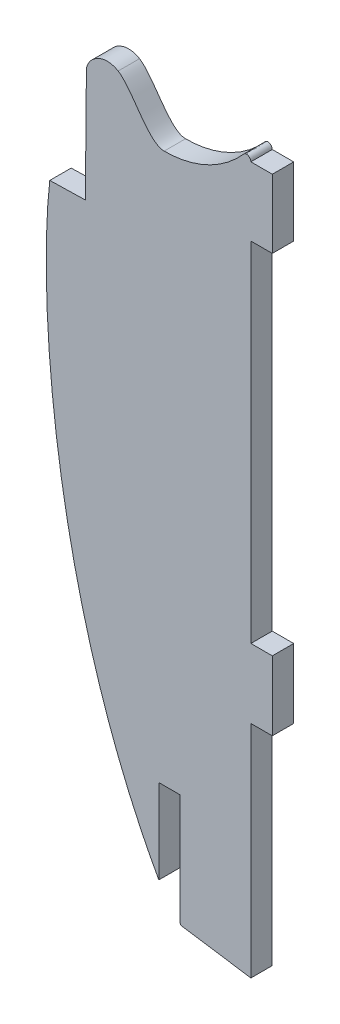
ISO-10303-21;
HEADER;
FILE_DESCRIPTION(('STEP AP214'),'2;1');
FILE_NAME('part.step','',(''),(''),'','','');
FILE_SCHEMA(('AUTOMOTIVE_DESIGN { 1 0 10303 214 1 1 1 1 }'));
ENDSEC;
DATA;
#1=APPLICATION_CONTEXT('core data for automotive mechanical design processes');
#2=APPLICATION_PROTOCOL_DEFINITION('international standard','automotive_design',2000,#1);
#3=PRODUCT_CONTEXT('',#1,'mechanical');
#4=PRODUCT('Part','Part','',(#3));
#5=PRODUCT_RELATED_PRODUCT_CATEGORY('part','',(#4));
#6=PRODUCT_DEFINITION_FORMATION('','',#4);
#7=PRODUCT_DEFINITION_CONTEXT('part definition',#1,'design');
#8=PRODUCT_DEFINITION('design','',#6,#7);
#9=PRODUCT_DEFINITION_SHAPE('','',#8);
#10=(LENGTH_UNIT() NAMED_UNIT(*) SI_UNIT(.MILLI.,.METRE.));
#11=(NAMED_UNIT(*) PLANE_ANGLE_UNIT() SI_UNIT($,.RADIAN.));
#12=(NAMED_UNIT(*) SI_UNIT($,.STERADIAN.) SOLID_ANGLE_UNIT());
#13=UNCERTAINTY_MEASURE_WITH_UNIT(LENGTH_MEASURE(1.E-05),#10,'distance_accuracy_value','');
#14=(GEOMETRIC_REPRESENTATION_CONTEXT(3) GLOBAL_UNCERTAINTY_ASSIGNED_CONTEXT((#13)) GLOBAL_UNIT_ASSIGNED_CONTEXT((#10,
#11,#12)) REPRESENTATION_CONTEXT('',''));
#15=CARTESIAN_POINT('',(0.,0.,0.));
#16=DIRECTION('',(0.,0.,1.));
#17=DIRECTION('',(1.,0.,0.));
#18=AXIS2_PLACEMENT_3D('',#15,#16,#17);
#19=CARTESIAN_POINT('',(661.833021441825,564.04560696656,3.));
#20=CARTESIAN_POINT('',(663.48081061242,559.870926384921,3.));
#21=CARTESIAN_POINT('',(665.367689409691,555.794258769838,3.));
#22=CARTESIAN_POINT('',(667.524146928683,551.909569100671,3.));
#23=B_SPLINE_CURVE_WITH_KNOTS('',3,(#19,#20,#21,#22),.UNSPECIFIED.,.F.,.F.,(4,4),(0.,1.),.UNSPECIFIED.);
#24=DIRECTION('',(0.,0.,-1.));
#25=VECTOR('',#24,1.);
#26=SURFACE_OF_LINEAR_EXTRUSION('',#23,#25);
#27=CARTESIAN_POINT('',(661.833021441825,564.04560696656,0.));
#28=CARTESIAN_POINT('',(663.48081061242,559.870926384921,0.));
#29=CARTESIAN_POINT('',(665.367689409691,555.794258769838,0.));
#30=CARTESIAN_POINT('',(667.524146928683,551.909569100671,0.));
#31=B_SPLINE_CURVE_WITH_KNOTS('',3,(#27,#28,#29,#30),.UNSPECIFIED.,.F.,.F.,(4,4),(0.,1.),.UNSPECIFIED.);
#32=CARTESIAN_POINT('',(661.833021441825,564.04560696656,0.));
#33=VERTEX_POINT('',#32);
#34=CARTESIAN_POINT('',(667.524146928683,551.909569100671,0.));
#35=VERTEX_POINT('',#34);
#36=EDGE_CURVE('E11',#33,#35,#31,.T.);
#37=ORIENTED_EDGE('',*,*,#36,.T.);
#38=DIRECTION('',(0.,0.,-1.));
#39=VECTOR('',#38,1.);
#40=CARTESIAN_POINT('',(667.524146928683,551.909569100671,3.));
#41=LINE('',#40,#39);
#42=CARTESIAN_POINT('',(667.524146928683,551.909569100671,3.));
#43=VERTEX_POINT('',#42);
#44=EDGE_CURVE('E940',#43,#35,#41,.T.);
#45=ORIENTED_EDGE('',*,*,#44,.F.);
#46=CARTESIAN_POINT('',(661.833021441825,564.04560696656,3.));
#47=VERTEX_POINT('',#46);
#48=EDGE_CURVE('E47',#47,#43,#23,.T.);
#49=ORIENTED_EDGE('',*,*,#48,.F.);
#50=DIRECTION('',(0.,0.,-1.));
#51=VECTOR('',#50,1.);
#52=CARTESIAN_POINT('',(661.833021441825,564.04560696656,3.));
#53=LINE('',#52,#51);
#54=EDGE_CURVE('E279',#47,#33,#53,.T.);
#55=ORIENTED_EDGE('',*,*,#54,.T.);
#56=EDGE_LOOP('',(#37,#45,#49,#55));
#57=FACE_BOUND('',#56,.T.);
#58=ADVANCED_FACE('F44',(#57),#26,.F.);
#59=CARTESIAN_POINT('',(667.524146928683,551.909569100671,3.));
#60=DIRECTION('',(-1.,0.,0.));
#61=DIRECTION('',(0.,0.,1.));
#62=AXIS2_PLACEMENT_3D('',#59,#60,#61);
#63=PLANE('',#62);
#64=DIRECTION('',(0.,1.,0.));
#65=VECTOR('',#64,1.);
#66=CARTESIAN_POINT('',(667.524146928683,551.909569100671,0.));
#67=LINE('',#66,#65);
#68=CARTESIAN_POINT('',(667.524146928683,563.738304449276,0.));
#69=VERTEX_POINT('',#68);
#70=EDGE_CURVE('E56',#35,#69,#67,.T.);
#71=ORIENTED_EDGE('',*,*,#70,.T.);
#72=DIRECTION('',(0.,0.,-1.));
#73=VECTOR('',#72,1.);
#74=CARTESIAN_POINT('',(667.524146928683,563.738304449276,3.));
#75=LINE('',#74,#73);
#76=CARTESIAN_POINT('',(667.524146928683,563.738304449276,3.));
#77=VERTEX_POINT('',#76);
#78=EDGE_CURVE('E245',#77,#69,#75,.T.);
#79=ORIENTED_EDGE('',*,*,#78,.F.);
#80=DIRECTION('',(0.,1.,0.));
#81=VECTOR('',#80,1.);
#82=CARTESIAN_POINT('',(667.524146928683,551.909569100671,3.));
#83=LINE('',#82,#81);
#84=EDGE_CURVE('E155',#43,#77,#83,.T.);
#85=ORIENTED_EDGE('',*,*,#84,.F.);
#86=ORIENTED_EDGE('',*,*,#44,.T.);
#87=EDGE_LOOP('',(#71,#79,#85,#86));
#88=FACE_BOUND('',#87,.T.);
#89=ADVANCED_FACE('F307',(#88),#63,.F.);
#90=CARTESIAN_POINT('',(667.524146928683,563.738304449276,3.));
#91=DIRECTION('',(0.,1.,0.));
#92=DIRECTION('',(0.,0.,1.));
#93=AXIS2_PLACEMENT_3D('',#90,#91,#92);
#94=PLANE('',#93);
#95=DIRECTION('',(1.,0.,0.));
#96=VECTOR('',#95,1.);
#97=CARTESIAN_POINT('',(667.524146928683,563.738304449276,0.));
#98=LINE('',#97,#96);
#99=CARTESIAN_POINT('',(670.52620313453,563.738304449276,0.));
#100=VERTEX_POINT('',#99);
#101=EDGE_CURVE('E240',#69,#100,#98,.T.);
#102=ORIENTED_EDGE('',*,*,#101,.T.);
#103=DIRECTION('',(0.,0.,-1.));
#104=VECTOR('',#103,1.);
#105=CARTESIAN_POINT('',(670.52620313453,563.738304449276,3.));
#106=LINE('',#105,#104);
#107=CARTESIAN_POINT('',(670.52620313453,563.738304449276,3.));
#108=VERTEX_POINT('',#107);
#109=EDGE_CURVE('E242',#108,#100,#106,.T.);
#110=ORIENTED_EDGE('',*,*,#109,.F.);
#111=DIRECTION('',(1.,0.,0.));
#112=VECTOR('',#111,1.);
#113=CARTESIAN_POINT('',(667.524146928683,563.738304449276,3.));
#114=LINE('',#113,#112);
#115=EDGE_CURVE('E351',#77,#108,#114,.T.);
#116=ORIENTED_EDGE('',*,*,#115,.F.);
#117=ORIENTED_EDGE('',*,*,#78,.T.);
#118=EDGE_LOOP('',(#102,#110,#116,#117));
#119=FACE_BOUND('',#118,.T.);
#120=ADVANCED_FACE('F239',(#119),#94,.F.);
#121=CARTESIAN_POINT('',(670.52620313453,563.738304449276,3.));
#122=DIRECTION('',(1.,0.,0.));
#123=DIRECTION('',(0.,0.,-1.));
#124=AXIS2_PLACEMENT_3D('',#121,#122,#123);
#125=PLANE('',#124);
#126=DIRECTION('',(0.,-1.,0.));
#127=VECTOR('',#126,1.);
#128=CARTESIAN_POINT('',(670.52620313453,563.738304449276,0.));
#129=LINE('',#128,#127);
#130=CARTESIAN_POINT('',(670.52620313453,548.092575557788,0.));
#131=VERTEX_POINT('',#130);
#132=EDGE_CURVE('E247',#100,#131,#129,.T.);
#133=ORIENTED_EDGE('',*,*,#132,.T.);
#134=DIRECTION('',(0.,0.,-1.));
#135=VECTOR('',#134,1.);
#136=CARTESIAN_POINT('',(670.52620313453,548.092575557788,3.));
#137=LINE('',#136,#135);
#138=CARTESIAN_POINT('',(670.52620313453,548.092575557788,3.));
#139=VERTEX_POINT('',#138);
#140=EDGE_CURVE('E255',#139,#131,#137,.T.);
#141=ORIENTED_EDGE('',*,*,#140,.F.);
#142=DIRECTION('',(0.,-1.,0.));
#143=VECTOR('',#142,1.);
#144=CARTESIAN_POINT('',(670.52620313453,563.738304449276,3.));
#145=LINE('',#144,#143);
#146=EDGE_CURVE('E252',#108,#139,#145,.T.);
#147=ORIENTED_EDGE('',*,*,#146,.F.);
#148=ORIENTED_EDGE('',*,*,#109,.T.);
#149=EDGE_LOOP('',(#133,#141,#147,#148));
#150=FACE_BOUND('',#149,.T.);
#151=ADVANCED_FACE('F246',(#150),#125,.F.);
#152=CARTESIAN_POINT('',(670.52620313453,548.092575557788,3.));
#153=DIRECTION('',(0.79190468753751,0.610644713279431,0.));
#154=DIRECTION('',(-0.610644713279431,0.79190468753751,0.));
#155=AXIS2_PLACEMENT_3D('',#152,#153,#154);
#156=PLANE('',#155);
#157=DIRECTION('',(0.610644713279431,-0.79190468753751,0.));
#158=VECTOR('',#157,1.);
#159=CARTESIAN_POINT('',(670.52620313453,548.092575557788,0.));
#160=LINE('',#159,#158);
#161=CARTESIAN_POINT('',(670.656772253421,547.923249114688,0.));
#162=VERTEX_POINT('',#161);
#163=EDGE_CURVE('E259',#131,#162,#160,.T.);
#164=ORIENTED_EDGE('',*,*,#163,.T.);
#165=DIRECTION('',(0.,0.,-1.));
#166=VECTOR('',#165,1.);
#167=CARTESIAN_POINT('',(670.656772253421,547.923249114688,3.));
#168=LINE('',#167,#166);
#169=CARTESIAN_POINT('',(670.656772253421,547.923249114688,3.));
#170=VERTEX_POINT('',#169);
#171=EDGE_CURVE('E466',#170,#162,#168,.T.);
#172=ORIENTED_EDGE('',*,*,#171,.F.);
#173=DIRECTION('',(0.610644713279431,-0.79190468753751,0.));
#174=VECTOR('',#173,1.);
#175=CARTESIAN_POINT('',(670.52620313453,548.092575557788,3.));
#176=LINE('',#175,#174);
#177=EDGE_CURVE('E349',#139,#170,#176,.T.);
#178=ORIENTED_EDGE('',*,*,#177,.F.);
#179=ORIENTED_EDGE('',*,*,#140,.T.);
#180=EDGE_LOOP('',(#164,#172,#178,#179));
#181=FACE_BOUND('',#180,.T.);
#182=ADVANCED_FACE('F317',(#181),#156,.F.);
#183=CARTESIAN_POINT('',(670.656772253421,547.923249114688,3.));
#184=DIRECTION('',(0.148954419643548,0.988844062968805,0.));
#185=DIRECTION('',(-0.988844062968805,0.148954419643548,0.));
#186=AXIS2_PLACEMENT_3D('',#183,#184,#185);
#187=PLANE('',#186);
#188=DIRECTION('',(0.988844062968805,-0.148954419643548,0.));
#189=VECTOR('',#188,1.);
#190=CARTESIAN_POINT('',(670.656772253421,547.923249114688,0.));
#191=LINE('',#190,#189);
#192=CARTESIAN_POINT('',(677.588821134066,546.879040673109,0.));
#193=VERTEX_POINT('',#192);
#194=EDGE_CURVE('E263',#162,#193,#191,.T.);
#195=ORIENTED_EDGE('',*,*,#194,.T.);
#196=DIRECTION('',(0.,0.,-1.));
#197=VECTOR('',#196,1.);
#198=CARTESIAN_POINT('',(677.588821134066,546.879040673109,3.));
#199=LINE('',#198,#197);
#200=CARTESIAN_POINT('',(677.588821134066,546.879040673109,3.));
#201=VERTEX_POINT('',#200);
#202=EDGE_CURVE('E467',#201,#193,#199,.T.);
#203=ORIENTED_EDGE('',*,*,#202,.F.);
#204=DIRECTION('',(0.988844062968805,-0.148954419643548,0.));
#205=VECTOR('',#204,1.);
#206=CARTESIAN_POINT('',(670.656772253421,547.923249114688,3.));
#207=LINE('',#206,#205);
#208=EDGE_CURVE('E342',#170,#201,#207,.T.);
#209=ORIENTED_EDGE('',*,*,#208,.F.);
#210=ORIENTED_EDGE('',*,*,#171,.T.);
#211=EDGE_LOOP('',(#195,#203,#209,#210));
#212=FACE_BOUND('',#211,.T.);
#213=ADVANCED_FACE('F325',(#212),#187,.F.);
#214=CARTESIAN_POINT('',(677.588821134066,546.879040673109,3.));
#215=CARTESIAN_POINT('',(677.592438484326,546.875423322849,3.));
#216=CARTESIAN_POINT('',(677.599500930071,546.875423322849,3.));
#217=CARTESIAN_POINT('',(677.602946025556,546.875423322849,3.));
#218=B_SPLINE_CURVE_WITH_KNOTS('',3,(#214,#215,#216,#217),.UNSPECIFIED.,.F.,.F.,(4,4),(6.,7.),.UNSPECIFIED.);
#219=DIRECTION('',(0.,0.,-1.));
#220=VECTOR('',#219,1.);
#221=SURFACE_OF_LINEAR_EXTRUSION('',#218,#220);
#222=CARTESIAN_POINT('',(677.588821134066,546.879040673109,0.));
#223=CARTESIAN_POINT('',(677.592438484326,546.875423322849,0.));
#224=CARTESIAN_POINT('',(677.599500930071,546.875423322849,0.));
#225=CARTESIAN_POINT('',(677.602946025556,546.875423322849,0.));
#226=B_SPLINE_CURVE_WITH_KNOTS('',3,(#222,#223,#224,#225),.UNSPECIFIED.,.F.,.F.,(4,4),(6.,7.),.UNSPECIFIED.);
#227=CARTESIAN_POINT('',(677.602946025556,546.875423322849,0.));
#228=VERTEX_POINT('',#227);
#229=EDGE_CURVE('E451',#193,#228,#226,.T.);
#230=ORIENTED_EDGE('',*,*,#229,.T.);
#231=DIRECTION('',(0.,0.,-1.));
#232=VECTOR('',#231,1.);
#233=CARTESIAN_POINT('',(677.602946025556,546.875423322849,3.));
#234=LINE('',#233,#232);
#235=CARTESIAN_POINT('',(677.602946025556,546.875423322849,3.));
#236=VERTEX_POINT('',#235);
#237=EDGE_CURVE('E475',#236,#228,#234,.T.);
#238=ORIENTED_EDGE('',*,*,#237,.F.);
#239=EDGE_CURVE('E331',#201,#236,#218,.T.);
#240=ORIENTED_EDGE('',*,*,#239,.F.);
#241=ORIENTED_EDGE('',*,*,#202,.T.);
#242=EDGE_LOOP('',(#230,#238,#240,#241));
#243=FACE_BOUND('',#242,.T.);
#244=ADVANCED_FACE('F326',(#243),#221,.F.);
#245=CARTESIAN_POINT('',(677.602946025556,546.875423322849,3.));
#246=DIRECTION('',(0.1491793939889,0.988810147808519,0.));
#247=DIRECTION('',(-0.988810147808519,0.1491793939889,0.));
#248=AXIS2_PLACEMENT_3D('',#245,#246,#247);
#249=PLANE('',#248);
#250=DIRECTION('',(0.988810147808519,-0.1491793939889,0.));
#251=VECTOR('',#250,1.);
#252=CARTESIAN_POINT('',(677.602946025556,546.875423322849,0.));
#253=LINE('',#252,#251);
#254=CARTESIAN_POINT('',(680.432230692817,546.448575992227,0.));
#255=VERTEX_POINT('',#254);
#256=EDGE_CURVE('E448',#228,#255,#253,.T.);
#257=ORIENTED_EDGE('',*,*,#256,.T.);
#258=DIRECTION('',(0.,0.,-1.));
#259=VECTOR('',#258,1.);
#260=CARTESIAN_POINT('',(680.432230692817,546.448575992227,3.));
#261=LINE('',#260,#259);
#262=CARTESIAN_POINT('',(680.432230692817,546.448575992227,3.));
#263=VERTEX_POINT('',#262);
#264=EDGE_CURVE('E485',#263,#255,#261,.T.);
#265=ORIENTED_EDGE('',*,*,#264,.F.);
#266=DIRECTION('',(0.988810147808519,-0.1491793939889,0.));
#267=VECTOR('',#266,1.);
#268=CARTESIAN_POINT('',(677.602946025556,546.875423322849,3.));
#269=LINE('',#268,#267);
#270=EDGE_CURVE('E344',#236,#263,#269,.T.);
#271=ORIENTED_EDGE('',*,*,#270,.F.);
#272=ORIENTED_EDGE('',*,*,#237,.T.);
#273=EDGE_LOOP('',(#257,#265,#271,#272));
#274=FACE_BOUND('',#273,.T.);
#275=ADVANCED_FACE('F332',(#274),#249,.F.);
#276=CARTESIAN_POINT('',(680.432230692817,571.77131971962,3.));
#277=DIRECTION('',(-1.,0.,0.));
#278=DIRECTION('',(0.,0.,1.));
#279=AXIS2_PLACEMENT_3D('',#276,#277,#278);
#280=PLANE('',#279);
#281=DIRECTION('',(0.,1.,0.));
#282=VECTOR('',#281,1.);
#283=CARTESIAN_POINT('',(680.432230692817,571.77131971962,0.));
#284=LINE('',#283,#282);
#285=CARTESIAN_POINT('',(680.432230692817,577.373131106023,0.));
#286=VERTEX_POINT('',#285);
#287=EDGE_CURVE('E449',#255,#286,#284,.T.);
#288=ORIENTED_EDGE('',*,*,#287,.T.);
#289=DIRECTION('',(0.,0.,-1.));
#290=VECTOR('',#289,1.);
#291=CARTESIAN_POINT('',(680.432230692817,577.373131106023,3.));
#292=LINE('',#291,#290);
#293=CARTESIAN_POINT('',(680.432230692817,577.373131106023,3.));
#294=VERTEX_POINT('',#293);
#295=EDGE_CURVE('E489',#294,#286,#292,.T.);
#296=ORIENTED_EDGE('',*,*,#295,.F.);
#297=DIRECTION('',(0.,1.,0.));
#298=VECTOR('',#297,1.);
#299=CARTESIAN_POINT('',(680.432230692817,546.448575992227,3.));
#300=LINE('',#299,#298);
#301=EDGE_CURVE('E488',#263,#294,#300,.T.);
#302=ORIENTED_EDGE('',*,*,#301,.F.);
#303=ORIENTED_EDGE('',*,*,#264,.T.);
#304=EDGE_LOOP('',(#288,#296,#302,#303));
#305=FACE_BOUND('',#304,.T.);
#306=ADVANCED_FACE('F484',(#305),#280,.F.);
#307=CARTESIAN_POINT('',(680.432230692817,577.373131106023,3.));
#308=DIRECTION('',(0.,1.,0.));
#309=DIRECTION('',(0.,0.,1.));
#310=AXIS2_PLACEMENT_3D('',#307,#308,#309);
#311=PLANE('',#310);
#312=DIRECTION('',(1.,0.,0.));
#313=VECTOR('',#312,1.);
#314=CARTESIAN_POINT('',(680.432230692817,577.373131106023,0.));
#315=LINE('',#314,#313);
#316=CARTESIAN_POINT('',(683.441521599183,577.373131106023,0.));
#317=VERTEX_POINT('',#316);
#318=EDGE_CURVE('E441',#286,#317,#315,.T.);
#319=ORIENTED_EDGE('',*,*,#318,.T.);
#320=DIRECTION('',(0.,0.,-1.));
#321=VECTOR('',#320,1.);
#322=CARTESIAN_POINT('',(683.441521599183,577.373131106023,3.));
#323=LINE('',#322,#321);
#324=CARTESIAN_POINT('',(683.441521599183,577.373131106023,3.));
#325=VERTEX_POINT('',#324);
#326=EDGE_CURVE('E493',#325,#317,#323,.T.);
#327=ORIENTED_EDGE('',*,*,#326,.F.);
#328=DIRECTION('',(1.,0.,0.));
#329=VECTOR('',#328,1.);
#330=CARTESIAN_POINT('',(680.432230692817,577.373131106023,3.));
#331=LINE('',#330,#329);
#332=EDGE_CURVE('E657',#294,#325,#331,.T.);
#333=ORIENTED_EDGE('',*,*,#332,.F.);
#334=ORIENTED_EDGE('',*,*,#295,.T.);
#335=EDGE_LOOP('',(#319,#327,#333,#334));
#336=FACE_BOUND('',#335,.T.);
#337=ADVANCED_FACE('F660',(#336),#311,.F.);
#338=CARTESIAN_POINT('',(683.441521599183,577.373131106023,3.));
#339=DIRECTION('',(-1.,0.,0.));
#340=DIRECTION('',(0.,0.,1.));
#341=AXIS2_PLACEMENT_3D('',#338,#339,#340);
#342=PLANE('',#341);
#343=DIRECTION('',(0.,1.,0.));
#344=VECTOR('',#343,1.);
#345=CARTESIAN_POINT('',(683.441521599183,577.373131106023,0.));
#346=LINE('',#345,#344);
#347=CARTESIAN_POINT('',(683.441521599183,587.092089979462,0.));
#348=VERTEX_POINT('',#347);
#349=EDGE_CURVE('E442',#317,#348,#346,.T.);
#350=ORIENTED_EDGE('',*,*,#349,.T.);
#351=DIRECTION('',(0.,0.,-1.));
#352=VECTOR('',#351,1.);
#353=CARTESIAN_POINT('',(683.441521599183,587.092089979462,3.));
#354=LINE('',#353,#352);
#355=CARTESIAN_POINT('',(683.441521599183,587.092089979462,3.));
#356=VERTEX_POINT('',#355);
#357=EDGE_CURVE('E502',#356,#348,#354,.T.);
#358=ORIENTED_EDGE('',*,*,#357,.F.);
#359=DIRECTION('',(0.,1.,0.));
#360=VECTOR('',#359,1.);
#361=CARTESIAN_POINT('',(683.441521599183,577.373131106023,3.));
#362=LINE('',#361,#360);
#363=EDGE_CURVE('E652',#325,#356,#362,.T.);
#364=ORIENTED_EDGE('',*,*,#363,.F.);
#365=ORIENTED_EDGE('',*,*,#326,.T.);
#366=EDGE_LOOP('',(#350,#358,#364,#365));
#367=FACE_BOUND('',#366,.T.);
#368=ADVANCED_FACE('F651',(#367),#342,.F.);
#369=CARTESIAN_POINT('',(683.441521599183,587.092089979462,3.));
#370=DIRECTION('',(0.,-1.,0.));
#371=DIRECTION('',(0.,0.,-1.));
#372=AXIS2_PLACEMENT_3D('',#369,#370,#371);
#373=PLANE('',#372);
#374=DIRECTION('',(-1.,0.,0.));
#375=VECTOR('',#374,1.);
#376=CARTESIAN_POINT('',(683.441521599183,587.092089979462,0.));
#377=LINE('',#376,#375);
#378=CARTESIAN_POINT('',(680.432230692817,587.092089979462,0.));
#379=VERTEX_POINT('',#378);
#380=EDGE_CURVE('E440',#348,#379,#377,.T.);
#381=ORIENTED_EDGE('',*,*,#380,.T.);
#382=DIRECTION('',(0.,0.,-1.));
#383=VECTOR('',#382,1.);
#384=CARTESIAN_POINT('',(680.432230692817,587.092089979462,3.));
#385=LINE('',#384,#383);
#386=CARTESIAN_POINT('',(680.432230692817,587.092089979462,3.));
#387=VERTEX_POINT('',#386);
#388=EDGE_CURVE('E503',#387,#379,#385,.T.);
#389=ORIENTED_EDGE('',*,*,#388,.F.);
#390=DIRECTION('',(-1.,0.,0.));
#391=VECTOR('',#390,1.);
#392=CARTESIAN_POINT('',(683.441521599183,587.092089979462,3.));
#393=LINE('',#392,#391);
#394=EDGE_CURVE('E650',#356,#387,#393,.T.);
#395=ORIENTED_EDGE('',*,*,#394,.F.);
#396=ORIENTED_EDGE('',*,*,#357,.T.);
#397=EDGE_LOOP('',(#381,#389,#395,#396));
#398=FACE_BOUND('',#397,.T.);
#399=ADVANCED_FACE('F646',(#398),#373,.F.);
#400=CARTESIAN_POINT('',(680.432230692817,629.102359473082,3.));
#401=DIRECTION('',(-1.,0.,0.));
#402=DIRECTION('',(0.,0.,1.));
#403=AXIS2_PLACEMENT_3D('',#400,#401,#402);
#404=PLANE('',#403);
#405=DIRECTION('',(0.,1.,0.));
#406=VECTOR('',#405,1.);
#407=CARTESIAN_POINT('',(680.432230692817,629.102359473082,0.));
#408=LINE('',#407,#406);
#409=CARTESIAN_POINT('',(680.432230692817,635.980061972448,0.));
#410=VERTEX_POINT('',#409);
#411=EDGE_CURVE('E432',#379,#410,#408,.T.);
#412=ORIENTED_EDGE('',*,*,#411,.T.);
#413=DIRECTION('',(0.,0.,-1.));
#414=VECTOR('',#413,1.);
#415=CARTESIAN_POINT('',(680.432230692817,635.980061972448,3.));
#416=LINE('',#415,#414);
#417=CARTESIAN_POINT('',(680.432230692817,635.980061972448,3.));
#418=VERTEX_POINT('',#417);
#419=EDGE_CURVE('E506',#418,#410,#416,.T.);
#420=ORIENTED_EDGE('',*,*,#419,.F.);
#421=DIRECTION('',(0.,1.,0.));
#422=VECTOR('',#421,1.);
#423=CARTESIAN_POINT('',(680.432230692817,587.092089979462,3.));
#424=LINE('',#423,#422);
#425=EDGE_CURVE('E645',#387,#418,#424,.T.);
#426=ORIENTED_EDGE('',*,*,#425,.F.);
#427=ORIENTED_EDGE('',*,*,#388,.T.);
#428=EDGE_LOOP('',(#412,#420,#426,#427));
#429=FACE_BOUND('',#428,.T.);
#430=ADVANCED_FACE('F643',(#429),#404,.F.);
#431=CARTESIAN_POINT('',(680.432230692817,635.980061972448,3.));
#432=DIRECTION('',(0.,1.,0.));
#433=DIRECTION('',(0.,0.,1.));
#434=AXIS2_PLACEMENT_3D('',#431,#432,#433);
#435=PLANE('',#434);
#436=DIRECTION('',(1.,0.,0.));
#437=VECTOR('',#436,1.);
#438=CARTESIAN_POINT('',(680.432230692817,635.980061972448,0.));
#439=LINE('',#438,#437);
#440=CARTESIAN_POINT('',(683.441521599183,635.980061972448,0.));
#441=VERTEX_POINT('',#440);
#442=EDGE_CURVE('E431',#410,#441,#439,.T.);
#443=ORIENTED_EDGE('',*,*,#442,.T.);
#444=DIRECTION('',(0.,0.,-1.));
#445=VECTOR('',#444,1.);
#446=CARTESIAN_POINT('',(683.441521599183,635.980061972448,3.));
#447=LINE('',#446,#445);
#448=CARTESIAN_POINT('',(683.441521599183,635.980061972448,3.));
#449=VERTEX_POINT('',#448);
#450=EDGE_CURVE('E511',#449,#441,#447,.T.);
#451=ORIENTED_EDGE('',*,*,#450,.F.);
#452=DIRECTION('',(1.,0.,0.));
#453=VECTOR('',#452,1.);
#454=CARTESIAN_POINT('',(680.432230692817,635.980061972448,3.));
#455=LINE('',#454,#453);
#456=EDGE_CURVE('E636',#418,#449,#455,.T.);
#457=ORIENTED_EDGE('',*,*,#456,.F.);
#458=ORIENTED_EDGE('',*,*,#419,.T.);
#459=EDGE_LOOP('',(#443,#451,#457,#458));
#460=FACE_BOUND('',#459,.T.);
#461=ADVANCED_FACE('F633',(#460),#435,.F.);
#462=CARTESIAN_POINT('',(683.441521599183,635.980061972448,3.));
#463=DIRECTION('',(-1.,0.,0.));
#464=DIRECTION('',(0.,0.,1.));
#465=AXIS2_PLACEMENT_3D('',#462,#463,#464);
#466=PLANE('',#465);
#467=DIRECTION('',(0.,1.,0.));
#468=VECTOR('',#467,1.);
#469=CARTESIAN_POINT('',(683.441521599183,635.980061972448,0.));
#470=LINE('',#469,#468);
#471=CARTESIAN_POINT('',(683.441521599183,645.600318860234,0.));
#472=VERTEX_POINT('',#471);
#473=EDGE_CURVE('E428',#441,#472,#470,.T.);
#474=ORIENTED_EDGE('',*,*,#473,.T.);
#475=DIRECTION('',(0.,0.,-1.));
#476=VECTOR('',#475,1.);
#477=CARTESIAN_POINT('',(683.441521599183,645.600318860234,3.));
#478=LINE('',#477,#476);
#479=CARTESIAN_POINT('',(683.441521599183,645.600318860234,3.));
#480=VERTEX_POINT('',#479);
#481=EDGE_CURVE('E519',#480,#472,#478,.T.);
#482=ORIENTED_EDGE('',*,*,#481,.F.);
#483=DIRECTION('',(0.,1.,0.));
#484=VECTOR('',#483,1.);
#485=CARTESIAN_POINT('',(683.441521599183,635.980061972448,3.));
#486=LINE('',#485,#484);
#487=EDGE_CURVE('E628',#449,#480,#486,.T.);
#488=ORIENTED_EDGE('',*,*,#487,.F.);
#489=ORIENTED_EDGE('',*,*,#450,.T.);
#490=EDGE_LOOP('',(#474,#482,#488,#489));
#491=FACE_BOUND('',#490,.T.);
#492=ADVANCED_FACE('F626',(#491),#466,.F.);
#493=CARTESIAN_POINT('',(683.441521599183,645.600318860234,3.));
#494=DIRECTION('',(0.,-1.,0.));
#495=DIRECTION('',(0.,0.,-1.));
#496=AXIS2_PLACEMENT_3D('',#493,#494,#495);
#497=PLANE('',#496);
#498=DIRECTION('',(-1.,0.,0.));
#499=VECTOR('',#498,1.);
#500=CARTESIAN_POINT('',(683.441521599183,645.600318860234,0.));
#501=LINE('',#500,#499);
#502=CARTESIAN_POINT('',(680.432230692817,645.600318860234,0.));
#503=VERTEX_POINT('',#502);
#504=EDGE_CURVE('E425',#472,#503,#501,.T.);
#505=ORIENTED_EDGE('',*,*,#504,.T.);
#506=DIRECTION('',(0.,0.,-1.));
#507=VECTOR('',#506,1.);
#508=CARTESIAN_POINT('',(680.432230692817,645.600318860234,3.));
#509=LINE('',#508,#507);
#510=CARTESIAN_POINT('',(680.432230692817,645.600318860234,3.));
#511=VERTEX_POINT('',#510);
#512=EDGE_CURVE('E522',#511,#503,#509,.T.);
#513=ORIENTED_EDGE('',*,*,#512,.F.);
#514=DIRECTION('',(-1.,0.,0.));
#515=VECTOR('',#514,1.);
#516=CARTESIAN_POINT('',(683.441521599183,645.600318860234,3.));
#517=LINE('',#516,#515);
#518=EDGE_CURVE('E623',#480,#511,#517,.T.);
#519=ORIENTED_EDGE('',*,*,#518,.F.);
#520=ORIENTED_EDGE('',*,*,#481,.T.);
#521=EDGE_LOOP('',(#505,#513,#519,#520));
#522=FACE_BOUND('',#521,.T.);
#523=ADVANCED_FACE('F624',(#522),#497,.F.);
#524=CARTESIAN_POINT('',(680.432230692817,645.600318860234,3.));
#525=CARTESIAN_POINT('',(680.432230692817,646.122423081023,3.));
#526=CARTESIAN_POINT('',(679.790237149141,646.446262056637,3.));
#527=CARTESIAN_POINT('',(679.444521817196,646.054554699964,3.));
#528=B_SPLINE_CURVE_WITH_KNOTS('',3,(#524,#525,#526,#527),.UNSPECIFIED.,.F.,.F.,(4,4),(20.,21.),.UNSPECIFIED.);
#529=DIRECTION('',(0.,0.,-1.));
#530=VECTOR('',#529,1.);
#531=SURFACE_OF_LINEAR_EXTRUSION('',#528,#530);
#532=CARTESIAN_POINT('',(680.432230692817,645.600318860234,0.));
#533=CARTESIAN_POINT('',(680.432230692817,646.122423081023,0.));
#534=CARTESIAN_POINT('',(679.790237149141,646.446262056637,0.));
#535=CARTESIAN_POINT('',(679.444521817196,646.054554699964,0.));
#536=B_SPLINE_CURVE_WITH_KNOTS('',3,(#532,#533,#534,#535),.UNSPECIFIED.,.F.,.F.,(4,4),(20.,21.),.UNSPECIFIED.);
#537=CARTESIAN_POINT('',(679.444521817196,646.054554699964,0.));
#538=VERTEX_POINT('',#537);
#539=EDGE_CURVE('E411',#503,#538,#536,.T.);
#540=ORIENTED_EDGE('',*,*,#539,.T.);
#541=DIRECTION('',(0.,0.,-1.));
#542=VECTOR('',#541,1.);
#543=CARTESIAN_POINT('',(679.444521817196,646.054554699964,3.));
#544=LINE('',#543,#542);
#545=CARTESIAN_POINT('',(679.444521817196,646.054554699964,3.));
#546=VERTEX_POINT('',#545);
#547=EDGE_CURVE('E523',#546,#538,#544,.T.);
#548=ORIENTED_EDGE('',*,*,#547,.F.);
#549=EDGE_CURVE('E622',#511,#546,#528,.T.);
#550=ORIENTED_EDGE('',*,*,#549,.F.);
#551=ORIENTED_EDGE('',*,*,#512,.T.);
#552=EDGE_LOOP('',(#540,#548,#550,#551));
#553=FACE_BOUND('',#552,.T.);
#554=ADVANCED_FACE('F620',(#553),#531,.F.);
#555=CARTESIAN_POINT('',(679.444521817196,646.054554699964,3.));
#556=CARTESIAN_POINT('',(676.583456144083,642.8230551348,3.));
#557=CARTESIAN_POINT('',(672.632362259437,640.822832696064,3.));
#558=CARTESIAN_POINT('',(668.268459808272,640.822832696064,3.));
#559=B_SPLINE_CURVE_WITH_KNOTS('',3,(#555,#556,#557,#558),.UNSPECIFIED.,.F.,.F.,(4,4),(21.,22.),.UNSPECIFIED.);
#560=DIRECTION('',(0.,0.,-1.));
#561=VECTOR('',#560,1.);
#562=SURFACE_OF_LINEAR_EXTRUSION('',#559,#561);
#563=CARTESIAN_POINT('',(679.444521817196,646.054554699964,0.));
#564=CARTESIAN_POINT('',(676.583456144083,642.8230551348,0.));
#565=CARTESIAN_POINT('',(672.632362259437,640.822832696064,0.));
#566=CARTESIAN_POINT('',(668.268459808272,640.822832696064,0.));
#567=B_SPLINE_CURVE_WITH_KNOTS('',3,(#563,#564,#565,#566),.UNSPECIFIED.,.F.,.F.,(4,4),(21.,22.),.UNSPECIFIED.);
#568=CARTESIAN_POINT('',(668.268459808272,640.822832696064,0.));
#569=VERTEX_POINT('',#568);
#570=EDGE_CURVE('E407',#538,#569,#567,.T.);
#571=ORIENTED_EDGE('',*,*,#570,.T.);
#572=DIRECTION('',(0.,0.,-1.));
#573=VECTOR('',#572,1.);
#574=CARTESIAN_POINT('',(668.268459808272,640.822832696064,3.));
#575=LINE('',#574,#573);
#576=CARTESIAN_POINT('',(668.268459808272,640.822832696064,3.));
#577=VERTEX_POINT('',#576);
#578=EDGE_CURVE('E530',#577,#569,#575,.T.);
#579=ORIENTED_EDGE('',*,*,#578,.F.);
#580=EDGE_CURVE('E614',#546,#577,#559,.T.);
#581=ORIENTED_EDGE('',*,*,#580,.F.);
#582=ORIENTED_EDGE('',*,*,#547,.T.);
#583=EDGE_LOOP('',(#571,#579,#581,#582));
#584=FACE_BOUND('',#583,.T.);
#585=ADVANCED_FACE('F612',(#584),#562,.F.);
#586=CARTESIAN_POINT('',(668.268459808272,640.822832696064,3.));
#587=CARTESIAN_POINT('',(665.971959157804,640.822832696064,3.));
#588=CARTESIAN_POINT('',(663.784668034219,646.139304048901,3.));
#589=CARTESIAN_POINT('',(661.816140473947,647.324589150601,3.));
#590=B_SPLINE_CURVE_WITH_KNOTS('',3,(#586,#587,#588,#589),.UNSPECIFIED.,.F.,.F.,(4,4),(22.,23.),.UNSPECIFIED.);
#591=DIRECTION('',(0.,0.,-1.));
#592=VECTOR('',#591,1.);
#593=SURFACE_OF_LINEAR_EXTRUSION('',#590,#592);
#594=CARTESIAN_POINT('',(668.268459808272,640.822832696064,0.));
#595=CARTESIAN_POINT('',(665.971959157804,640.822832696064,0.));
#596=CARTESIAN_POINT('',(663.784668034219,646.139304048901,0.));
#597=CARTESIAN_POINT('',(661.816140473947,647.324589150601,0.));
#598=B_SPLINE_CURVE_WITH_KNOTS('',3,(#594,#595,#596,#597),.UNSPECIFIED.,.F.,.F.,(4,4),(22.,23.),.UNSPECIFIED.);
#599=CARTESIAN_POINT('',(661.816140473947,647.324589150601,0.));
#600=VERTEX_POINT('',#599);
#601=EDGE_CURVE('E400',#569,#600,#598,.T.);
#602=ORIENTED_EDGE('',*,*,#601,.T.);
#603=DIRECTION('',(0.,0.,-1.));
#604=VECTOR('',#603,1.);
#605=CARTESIAN_POINT('',(661.816140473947,647.324589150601,3.));
#606=LINE('',#605,#604);
#607=CARTESIAN_POINT('',(661.816140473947,647.324589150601,3.));
#608=VERTEX_POINT('',#607);
#609=EDGE_CURVE('E531',#608,#600,#606,.T.);
#610=ORIENTED_EDGE('',*,*,#609,.F.);
#611=EDGE_CURVE('E610',#577,#608,#590,.T.);
#612=ORIENTED_EDGE('',*,*,#611,.F.);
#613=ORIENTED_EDGE('',*,*,#578,.T.);
#614=EDGE_LOOP('',(#602,#610,#612,#613));
#615=FACE_BOUND('',#614,.T.);
#616=ADVANCED_FACE('F607',(#615),#593,.F.);
#617=CARTESIAN_POINT('',(661.816140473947,647.324589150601,3.));
#618=CARTESIAN_POINT('',(660.03812669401,648.39704737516,3.));
#619=CARTESIAN_POINT('',(657.82275804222,647.345776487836,3.));
#620=CARTESIAN_POINT('',(657.364043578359,645.451318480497,3.));
#621=B_SPLINE_CURVE_WITH_KNOTS('',3,(#617,#618,#619,#620),.UNSPECIFIED.,.F.,.F.,(4,4),(23.,24.),.UNSPECIFIED.);
#622=DIRECTION('',(0.,0.,-1.));
#623=VECTOR('',#622,1.);
#624=SURFACE_OF_LINEAR_EXTRUSION('',#621,#623);
#625=CARTESIAN_POINT('',(661.816140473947,647.324589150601,0.));
#626=CARTESIAN_POINT('',(660.03812669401,648.39704737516,0.));
#627=CARTESIAN_POINT('',(657.82275804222,647.345776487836,0.));
#628=CARTESIAN_POINT('',(657.364043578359,645.451318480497,0.));
#629=B_SPLINE_CURVE_WITH_KNOTS('',3,(#625,#626,#627,#628),.UNSPECIFIED.,.F.,.F.,(4,4),(23.,24.),.UNSPECIFIED.);
#630=CARTESIAN_POINT('',(657.364043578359,645.451318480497,0.));
#631=VERTEX_POINT('',#630);
#632=EDGE_CURVE('E395',#600,#631,#629,.T.);
#633=ORIENTED_EDGE('',*,*,#632,.T.);
#634=DIRECTION('',(0.,0.,-1.));
#635=VECTOR('',#634,1.);
#636=CARTESIAN_POINT('',(657.364043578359,645.451318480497,3.));
#637=LINE('',#636,#635);
#638=CARTESIAN_POINT('',(657.364043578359,645.451318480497,3.));
#639=VERTEX_POINT('',#638);
#640=EDGE_CURVE('E540',#639,#631,#637,.T.);
#641=ORIENTED_EDGE('',*,*,#640,.F.);
#642=EDGE_CURVE('E602',#608,#639,#621,.T.);
#643=ORIENTED_EDGE('',*,*,#642,.F.);
#644=ORIENTED_EDGE('',*,*,#609,.T.);
#645=EDGE_LOOP('',(#633,#641,#643,#644));
#646=FACE_BOUND('',#645,.T.);
#647=ADVANCED_FACE('F599',(#646),#624,.F.);
#648=CARTESIAN_POINT('',(657.364043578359,645.451318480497,3.));
#649=DIRECTION('',(0.999957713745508,-0.0091962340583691,0.));
#650=DIRECTION('',(0.0091962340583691,0.999957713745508,0.));
#651=AXIS2_PLACEMENT_3D('',#648,#649,#650);
#652=PLANE('',#651);
#653=DIRECTION('',(-0.0091962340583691,-0.999957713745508,0.));
#654=VECTOR('',#653,1.);
#655=CARTESIAN_POINT('',(657.364043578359,645.451318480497,0.));
#656=LINE('',#655,#654);
#657=CARTESIAN_POINT('',(657.289457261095,637.34113307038,0.));
#658=VERTEX_POINT('',#657);
#659=EDGE_CURVE('E388',#631,#658,#656,.T.);
#660=ORIENTED_EDGE('',*,*,#659,.T.);
#661=DIRECTION('',(0.,0.,-1.));
#662=VECTOR('',#661,1.);
#663=CARTESIAN_POINT('',(657.289457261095,637.34113307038,3.));
#664=LINE('',#663,#662);
#665=CARTESIAN_POINT('',(657.289457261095,637.34113307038,3.));
#666=VERTEX_POINT('',#665);
#667=EDGE_CURVE('E541',#666,#658,#664,.T.);
#668=ORIENTED_EDGE('',*,*,#667,.F.);
#669=DIRECTION('',(-0.0091962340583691,-0.999957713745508,0.));
#670=VECTOR('',#669,1.);
#671=CARTESIAN_POINT('',(657.364043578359,645.451318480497,3.));
#672=LINE('',#671,#670);
#673=EDGE_CURVE('E592',#639,#666,#672,.T.);
#674=ORIENTED_EDGE('',*,*,#673,.F.);
#675=ORIENTED_EDGE('',*,*,#640,.T.);
#676=EDGE_LOOP('',(#660,#668,#674,#675));
#677=FACE_BOUND('',#676,.T.);
#678=ADVANCED_FACE('F593',(#677),#652,.F.);
#679=CARTESIAN_POINT('',(657.289457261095,637.34113307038,3.));
#680=DIRECTION('',(0.999956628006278,-0.00931354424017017,0.));
#681=DIRECTION('',(0.00931354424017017,0.999956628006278,0.));
#682=AXIS2_PLACEMENT_3D('',#679,#680,#681);
#683=PLANE('',#682);
#684=DIRECTION('',(-0.00931354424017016,-0.999956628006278,0.));
#685=VECTOR('',#684,1.);
#686=CARTESIAN_POINT('',(657.289457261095,637.34113307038,0.));
#687=LINE('',#686,#685);
#688=CARTESIAN_POINT('',(657.285926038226,636.962000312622,0.));
#689=VERTEX_POINT('',#688);
#690=EDGE_CURVE('E390',#658,#689,#687,.T.);
#691=ORIENTED_EDGE('',*,*,#690,.T.);
#692=DIRECTION('',(0.,0.,-1.));
#693=VECTOR('',#692,1.);
#694=CARTESIAN_POINT('',(657.285926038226,636.962000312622,3.));
#695=LINE('',#694,#693);
#696=CARTESIAN_POINT('',(657.285926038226,636.962000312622,3.));
#697=VERTEX_POINT('',#696);
#698=EDGE_CURVE('E544',#697,#689,#695,.T.);
#699=ORIENTED_EDGE('',*,*,#698,.F.);
#700=DIRECTION('',(-0.00931354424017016,-0.999956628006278,0.));
#701=VECTOR('',#700,1.);
#702=CARTESIAN_POINT('',(657.289457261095,637.34113307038,3.));
#703=LINE('',#702,#701);
#704=EDGE_CURVE('E589',#666,#697,#703,.T.);
#705=ORIENTED_EDGE('',*,*,#704,.F.);
#706=ORIENTED_EDGE('',*,*,#667,.T.);
#707=EDGE_LOOP('',(#691,#699,#705,#706));
#708=FACE_BOUND('',#707,.T.);
#709=ADVANCED_FACE('F586',(#708),#683,.F.);
#710=CARTESIAN_POINT('',(657.285926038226,636.962000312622,3.));
#711=DIRECTION('',(0.999957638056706,-0.00920446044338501,0.));
#712=DIRECTION('',(0.00920446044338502,0.999957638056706,0.));
#713=AXIS2_PLACEMENT_3D('',#710,#711,#712);
#714=PLANE('',#713);
#715=DIRECTION('',(-0.00920446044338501,-0.999957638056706,0.));
#716=VECTOR('',#715,1.);
#717=CARTESIAN_POINT('',(657.285926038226,636.962000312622,0.));
#718=LINE('',#717,#716);
#719=CARTESIAN_POINT('',(657.215904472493,629.354971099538,0.));
#720=VERTEX_POINT('',#719);
#721=EDGE_CURVE('E383',#689,#720,#718,.T.);
#722=ORIENTED_EDGE('',*,*,#721,.T.);
#723=DIRECTION('',(0.,0.,-1.));
#724=VECTOR('',#723,1.);
#725=CARTESIAN_POINT('',(657.215904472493,629.354971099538,3.));
#726=LINE('',#725,#724);
#727=CARTESIAN_POINT('',(657.215904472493,629.354971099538,3.));
#728=VERTEX_POINT('',#727);
#729=EDGE_CURVE('E548',#728,#720,#726,.T.);
#730=ORIENTED_EDGE('',*,*,#729,.F.);
#731=DIRECTION('',(-0.00920446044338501,-0.999957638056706,0.));
#732=VECTOR('',#731,1.);
#733=CARTESIAN_POINT('',(657.285926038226,636.962000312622,3.));
#734=LINE('',#733,#732);
#735=EDGE_CURVE('E584',#697,#728,#734,.T.);
#736=ORIENTED_EDGE('',*,*,#735,.F.);
#737=ORIENTED_EDGE('',*,*,#698,.T.);
#738=EDGE_LOOP('',(#722,#730,#736,#737));
#739=FACE_BOUND('',#738,.T.);
#740=ADVANCED_FACE('F582',(#739),#714,.F.);
#741=CARTESIAN_POINT('',(657.215904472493,629.354971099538,3.));
#742=DIRECTION('',(0.0226312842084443,-0.999743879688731,0.));
#743=DIRECTION('',(0.999743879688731,0.0226312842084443,0.));
#744=AXIS2_PLACEMENT_3D('',#741,#742,#743);
#745=PLANE('',#744);
#746=DIRECTION('',(-0.999743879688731,-0.0226312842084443,0.));
#747=VECTOR('',#746,1.);
#748=CARTESIAN_POINT('',(657.215904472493,629.354971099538,0.));
#749=LINE('',#748,#747);
#750=CARTESIAN_POINT('',(652.22413336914,629.241971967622,0.));
#751=VERTEX_POINT('',#750);
#752=EDGE_CURVE('E378',#720,#751,#749,.T.);
#753=ORIENTED_EDGE('',*,*,#752,.T.);
#754=DIRECTION('',(0.,0.,-1.));
#755=VECTOR('',#754,1.);
#756=CARTESIAN_POINT('',(652.22413336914,629.241971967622,3.));
#757=LINE('',#756,#755);
#758=CARTESIAN_POINT('',(652.22413336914,629.241971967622,3.));
#759=VERTEX_POINT('',#758);
#760=EDGE_CURVE('E554',#759,#751,#757,.T.);
#761=ORIENTED_EDGE('',*,*,#760,.F.);
#762=DIRECTION('',(-0.999743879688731,-0.0226312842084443,0.));
#763=VECTOR('',#762,1.);
#764=CARTESIAN_POINT('',(657.215904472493,629.354971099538,3.));
#765=LINE('',#764,#763);
#766=EDGE_CURVE('E577',#728,#759,#765,.T.);
#767=ORIENTED_EDGE('',*,*,#766,.F.);
#768=ORIENTED_EDGE('',*,*,#729,.T.);
#769=EDGE_LOOP('',(#753,#761,#767,#768));
#770=FACE_BOUND('',#769,.T.);
#771=ADVANCED_FACE('F573',(#770),#745,.F.);
#772=CARTESIAN_POINT('',(652.22413336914,629.241971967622,3.));
#773=CARTESIAN_POINT('',(650.77495395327,616.817407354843,3.));
#774=CARTESIAN_POINT('',(652.095717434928,588.98026068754,3.));
#775=CARTESIAN_POINT('',(661.677733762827,564.442137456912,3.));
#776=B_SPLINE_CURVE_WITH_KNOTS('',3,(#772,#773,#774,#775),.UNSPECIFIED.,.F.,.F.,(4,4),(28.,29.),.UNSPECIFIED.);
#777=DIRECTION('',(0.,0.,-1.));
#778=VECTOR('',#777,1.);
#779=SURFACE_OF_LINEAR_EXTRUSION('',#776,#778);
#780=CARTESIAN_POINT('',(652.22413336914,629.241971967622,0.));
#781=CARTESIAN_POINT('',(650.77495395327,616.817407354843,0.));
#782=CARTESIAN_POINT('',(652.095717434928,588.98026068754,0.));
#783=CARTESIAN_POINT('',(661.677733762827,564.442137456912,0.));
#784=B_SPLINE_CURVE_WITH_KNOTS('',3,(#780,#781,#782,#783),.UNSPECIFIED.,.F.,.F.,(4,4),(28.,29.),.UNSPECIFIED.);
#785=CARTESIAN_POINT('',(661.677733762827,564.442137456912,0.));
#786=VERTEX_POINT('',#785);
#787=EDGE_CURVE('E365',#751,#786,#784,.T.);
#788=ORIENTED_EDGE('',*,*,#787,.T.);
#789=DIRECTION('',(0.,0.,-1.));
#790=VECTOR('',#789,1.);
#791=CARTESIAN_POINT('',(661.677733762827,564.442137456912,3.));
#792=LINE('',#791,#790);
#793=CARTESIAN_POINT('',(661.677733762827,564.442137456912,3.));
#794=VERTEX_POINT('',#793);
#795=EDGE_CURVE('E559',#794,#786,#792,.T.);
#796=ORIENTED_EDGE('',*,*,#795,.F.);
#797=EDGE_CURVE('E281',#759,#794,#776,.T.);
#798=ORIENTED_EDGE('',*,*,#797,.F.);
#799=ORIENTED_EDGE('',*,*,#760,.T.);
#800=EDGE_LOOP('',(#788,#796,#798,#799));
#801=FACE_BOUND('',#800,.T.);
#802=ADVANCED_FACE('F300',(#801),#779,.F.);
#803=CARTESIAN_POINT('',(661.677733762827,564.442137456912,3.));
#804=CARTESIAN_POINT('',(661.681523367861,564.447735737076,3.));
#805=CARTESIAN_POINT('',(661.685226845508,564.453420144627,3.));
#806=CARTESIAN_POINT('',(661.689016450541,564.45901842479,3.));
#807=B_SPLINE_CURVE_WITH_KNOTS('',3,(#803,#804,#805,#806),.UNSPECIFIED.,.F.,.F.,(4,4),(29.,30.),.UNSPECIFIED.);
#808=DIRECTION('',(0.,0.,-1.));
#809=VECTOR('',#808,1.);
#810=SURFACE_OF_LINEAR_EXTRUSION('',#807,#809);
#811=CARTESIAN_POINT('',(661.677733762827,564.442137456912,0.));
#812=CARTESIAN_POINT('',(661.681523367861,564.447735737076,0.));
#813=CARTESIAN_POINT('',(661.685226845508,564.453420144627,0.));
#814=CARTESIAN_POINT('',(661.689016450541,564.45901842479,0.));
#815=B_SPLINE_CURVE_WITH_KNOTS('',3,(#811,#812,#813,#814),.UNSPECIFIED.,.F.,.F.,(4,4),(29.,30.),.UNSPECIFIED.);
#816=CARTESIAN_POINT('',(661.689016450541,564.45901842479,0.));
#817=VERTEX_POINT('',#816);
#818=EDGE_CURVE('E363',#786,#817,#815,.T.);
#819=ORIENTED_EDGE('',*,*,#818,.T.);
#820=DIRECTION('',(0.,0.,-1.));
#821=VECTOR('',#820,1.);
#822=CARTESIAN_POINT('',(661.689016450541,564.45901842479,3.));
#823=LINE('',#822,#821);
#824=CARTESIAN_POINT('',(661.689016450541,564.45901842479,3.));
#825=VERTEX_POINT('',#824);
#826=EDGE_CURVE('E558',#825,#817,#823,.T.);
#827=ORIENTED_EDGE('',*,*,#826,.F.);
#828=EDGE_CURVE('E280',#794,#825,#807,.T.);
#829=ORIENTED_EDGE('',*,*,#828,.F.);
#830=ORIENTED_EDGE('',*,*,#795,.T.);
#831=EDGE_LOOP('',(#819,#827,#829,#830));
#832=FACE_BOUND('',#831,.T.);
#833=ADVANCED_FACE('F291',(#832),#810,.F.);
#834=CARTESIAN_POINT('',(661.689016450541,564.45901842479,3.));
#835=DIRECTION('',(0.944348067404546,0.328947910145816,0.));
#836=DIRECTION('',(-0.328947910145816,0.944348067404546,0.));
#837=AXIS2_PLACEMENT_3D('',#834,#835,#836);
#838=PLANE('',#837);
#839=DIRECTION('',(0.328947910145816,-0.944348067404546,0.));
#840=VECTOR('',#839,1.);
#841=CARTESIAN_POINT('',(661.689016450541,564.45901842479,0.));
#842=LINE('',#841,#840);
#843=EDGE_CURVE('E162',#817,#33,#842,.T.);
#844=ORIENTED_EDGE('',*,*,#843,.T.);
#845=ORIENTED_EDGE('',*,*,#54,.F.);
#846=DIRECTION('',(0.328947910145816,-0.944348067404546,0.));
#847=VECTOR('',#846,1.);
#848=CARTESIAN_POINT('',(661.689016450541,564.45901842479,3.));
#849=LINE('',#848,#847);
#850=EDGE_CURVE('E271',#825,#47,#849,.T.);
#851=ORIENTED_EDGE('',*,*,#850,.F.);
#852=ORIENTED_EDGE('',*,*,#826,.T.);
#853=EDGE_LOOP('',(#844,#845,#851,#852));
#854=FACE_BOUND('',#853,.T.);
#855=ADVANCED_FACE('F299',(#854),#838,.F.);
#856=CARTESIAN_POINT('',(664.487833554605,557.868841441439,3.));
#857=DIRECTION('',(0.,0.,-1.));
#858=DIRECTION('',(-1.,0.,0.));
#859=AXIS2_PLACEMENT_3D('',#856,#857,#858);
#860=PLANE('',#859);
#861=ORIENTED_EDGE('',*,*,#48,.T.);
#862=ORIENTED_EDGE('',*,*,#84,.T.);
#863=ORIENTED_EDGE('',*,*,#115,.T.);
#864=ORIENTED_EDGE('',*,*,#146,.T.);
#865=ORIENTED_EDGE('',*,*,#177,.T.);
#866=ORIENTED_EDGE('',*,*,#208,.T.);
#867=ORIENTED_EDGE('',*,*,#239,.T.);
#868=ORIENTED_EDGE('',*,*,#270,.T.);
#869=ORIENTED_EDGE('',*,*,#301,.T.);
#870=ORIENTED_EDGE('',*,*,#332,.T.);
#871=ORIENTED_EDGE('',*,*,#363,.T.);
#872=ORIENTED_EDGE('',*,*,#394,.T.);
#873=ORIENTED_EDGE('',*,*,#425,.T.);
#874=ORIENTED_EDGE('',*,*,#456,.T.);
#875=ORIENTED_EDGE('',*,*,#487,.T.);
#876=ORIENTED_EDGE('',*,*,#518,.T.);
#877=ORIENTED_EDGE('',*,*,#549,.T.);
#878=ORIENTED_EDGE('',*,*,#580,.T.);
#879=ORIENTED_EDGE('',*,*,#611,.T.);
#880=ORIENTED_EDGE('',*,*,#642,.T.);
#881=ORIENTED_EDGE('',*,*,#673,.T.);
#882=ORIENTED_EDGE('',*,*,#704,.T.);
#883=ORIENTED_EDGE('',*,*,#735,.T.);
#884=ORIENTED_EDGE('',*,*,#766,.T.);
#885=ORIENTED_EDGE('',*,*,#797,.T.);
#886=ORIENTED_EDGE('',*,*,#828,.T.);
#887=ORIENTED_EDGE('',*,*,#850,.T.);
#888=EDGE_LOOP('',(#861,#862,#863,#864,#865,#866,#867,#868,#869,#870,#871,#872,#873,#874,#875,
#876,#877,#878,#879,#880,#881,#882,#883,#884,#885,#886,#887));
#889=FACE_BOUND('',#888,.T.);
#890=ADVANCED_FACE('F50',(#889),#860,.F.);
#891=CARTESIAN_POINT('',(664.487833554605,557.868841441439,0.));
#892=DIRECTION('',(0.,0.,-1.));
#893=DIRECTION('',(-1.,0.,0.));
#894=AXIS2_PLACEMENT_3D('',#891,#892,#893);
#895=PLANE('',#894);
#896=ORIENTED_EDGE('',*,*,#36,.F.);
#897=ORIENTED_EDGE('',*,*,#843,.F.);
#898=ORIENTED_EDGE('',*,*,#818,.F.);
#899=ORIENTED_EDGE('',*,*,#787,.F.);
#900=ORIENTED_EDGE('',*,*,#752,.F.);
#901=ORIENTED_EDGE('',*,*,#721,.F.);
#902=ORIENTED_EDGE('',*,*,#690,.F.);
#903=ORIENTED_EDGE('',*,*,#659,.F.);
#904=ORIENTED_EDGE('',*,*,#632,.F.);
#905=ORIENTED_EDGE('',*,*,#601,.F.);
#906=ORIENTED_EDGE('',*,*,#570,.F.);
#907=ORIENTED_EDGE('',*,*,#539,.F.);
#908=ORIENTED_EDGE('',*,*,#504,.F.);
#909=ORIENTED_EDGE('',*,*,#473,.F.);
#910=ORIENTED_EDGE('',*,*,#442,.F.);
#911=ORIENTED_EDGE('',*,*,#411,.F.);
#912=ORIENTED_EDGE('',*,*,#380,.F.);
#913=ORIENTED_EDGE('',*,*,#349,.F.);
#914=ORIENTED_EDGE('',*,*,#318,.F.);
#915=ORIENTED_EDGE('',*,*,#287,.F.);
#916=ORIENTED_EDGE('',*,*,#256,.F.);
#917=ORIENTED_EDGE('',*,*,#229,.F.);
#918=ORIENTED_EDGE('',*,*,#194,.F.);
#919=ORIENTED_EDGE('',*,*,#163,.F.);
#920=ORIENTED_EDGE('',*,*,#132,.F.);
#921=ORIENTED_EDGE('',*,*,#101,.F.);
#922=ORIENTED_EDGE('',*,*,#70,.F.);
#923=EDGE_LOOP('',(#896,#897,#898,#899,#900,#901,#902,#903,#904,#905,#906,#907,#908,#909,#910,
#911,#912,#913,#914,#915,#916,#917,#918,#919,#920,#921,#922));
#924=FACE_BOUND('',#923,.T.);
#925=ADVANCED_FACE('F260',(#924),#895,.T.);
#926=CLOSED_SHELL('',(#58,#89,#120,#151,#182,#213,#244,#275,#306,#337,#368,#399,#430,#461,#492,
#523,#554,#585,#616,#647,#678,#709,#740,#771,#802,#833,#855,#890,#925));
#927=MANIFOLD_SOLID_BREP('B2',#926);
#928=ADVANCED_BREP_SHAPE_REPRESENTATION('',(#18,#927),#14);
#929=SHAPE_DEFINITION_REPRESENTATION(#9,#928);
ENDSEC;
END-ISO-10303-21;
